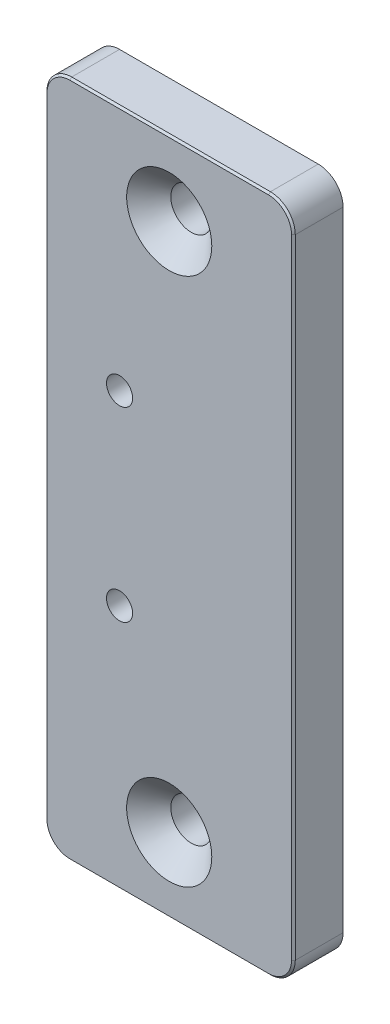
from build123d import *

# Parameters (mm, degrees)
SKIZZE2_R                                            = 3.3
AUFSATZ_LINEAR_AUSTRAGEN1_DEPTH                      = 8
FORMSENKUNG_F_R_M6_SENKSCHRAUBE_MIT_INNE_D           = 6.6
FORMSENKUNG_F_R_M6_SENKSCHRAUBE_MIT_INNE_DEPTH       = 11.5
FORMSENKUNG_F_R_M6_SENKSCHRAUBE_MIT_INNE_CSINK_D     = 13.71
FORMSENKUNG_F_R_M6_SENKSCHRAUBE_MIT_INNE_CSINK_ANGLE = 90
FORMSENKUNG_F_R_M6_SENKSCHRAUBE_MIT_INNE_TIP         = 1.982840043
FASE1_SIZE                                           = 0.3
M5_GEWINDEBOHRUNG2_D                                 = 4.2
M5_GEWINDEBOHRUNG2_DEPTH                             = 14
M5_GEWINDEBOHRUNG2_TIP                               = 1.2618073


with BuildPart() as part:
    # Skizze2 → Aufsatz-Linear austragen1 (new body)
    with BuildSketch(Plane.XY):
        with BuildLine():
            Line((-16, 0), (16, 0))
            ThreePointArc((16, 0), (18.828427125, 1.171572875), (20, 4))
            Line((20, 4), (20, 105.2))
            ThreePointArc((20, 105.2), (18.828427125, 108.028427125), (16, 109.2))
            Line((16, 109.2), (-16, 109.2))
            ThreePointArc((-16, 109.2), (-18.828427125, 108.028427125), (-20, 105.2))
            Line((-20, 105.2), (-20, 4))
            ThreePointArc((-20, 4), (-18.828427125, 1.171572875), (-16, 0))
        make_face()
        with Locations((0, 97.2)):
            Circle(SKIZZE2_R, mode=Mode.SUBTRACT)
        with Locations((0, 12)):
            Circle(SKIZZE2_R, mode=Mode.SUBTRACT)
    extrude(amount=AUFSATZ_LINEAR_AUSTRAGEN1_DEPTH)

    # Formsenkung f_r M6 Senkschraube mit Inne
    with Locations(Plane.XY.offset(8)):
        with Locations((0, 97.2), (0, 12)):
            CounterSinkHole(FORMSENKUNG_F_R_M6_SENKSCHRAUBE_MIT_INNE_D / 2, FORMSENKUNG_F_R_M6_SENKSCHRAUBE_MIT_INNE_CSINK_D / 2, depth=FORMSENKUNG_F_R_M6_SENKSCHRAUBE_MIT_INNE_DEPTH, counter_sink_angle=FORMSENKUNG_F_R_M6_SENKSCHRAUBE_MIT_INNE_CSINK_ANGLE)
            with Locations((0, 0, -(FORMSENKUNG_F_R_M6_SENKSCHRAUBE_MIT_INNE_DEPTH + FORMSENKUNG_F_R_M6_SENKSCHRAUBE_MIT_INNE_TIP / 2))):  # 118° drill point
                Cone(0, FORMSENKUNG_F_R_M6_SENKSCHRAUBE_MIT_INNE_D / 2, FORMSENKUNG_F_R_M6_SENKSCHRAUBE_MIT_INNE_TIP, mode=Mode.SUBTRACT)

    # Fase1
    fase1_edges = [part.edges().sort_by_distance(p)[0] for p in [
        (18.828427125, 1.171572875, 8),
        (20, 54.6, 8),
        (18.828427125, 108.028427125, 8),
        (0, 109.2, 8),
        (-18.828427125, 108.028427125, 8),
        (-20, 54.6, 8),
        (-18.828427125, 1.171572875, 8),
        (0, 0, 8),
    ]]
    chamfer(fase1_edges, length=FASE1_SIZE)

    # M5 Gewindebohrung2
    with Locations(Plane.XY.offset(8)):
        with Locations((-8, 69.6), (-8, 39.6)):
            Hole(M5_GEWINDEBOHRUNG2_D / 2, depth=M5_GEWINDEBOHRUNG2_DEPTH)
            with Locations((0, 0, -(M5_GEWINDEBOHRUNG2_DEPTH + M5_GEWINDEBOHRUNG2_TIP / 2))):  # 118° drill point
                Cone(0, M5_GEWINDEBOHRUNG2_D / 2, M5_GEWINDEBOHRUNG2_TIP, mode=Mode.SUBTRACT)


solid = part.part
